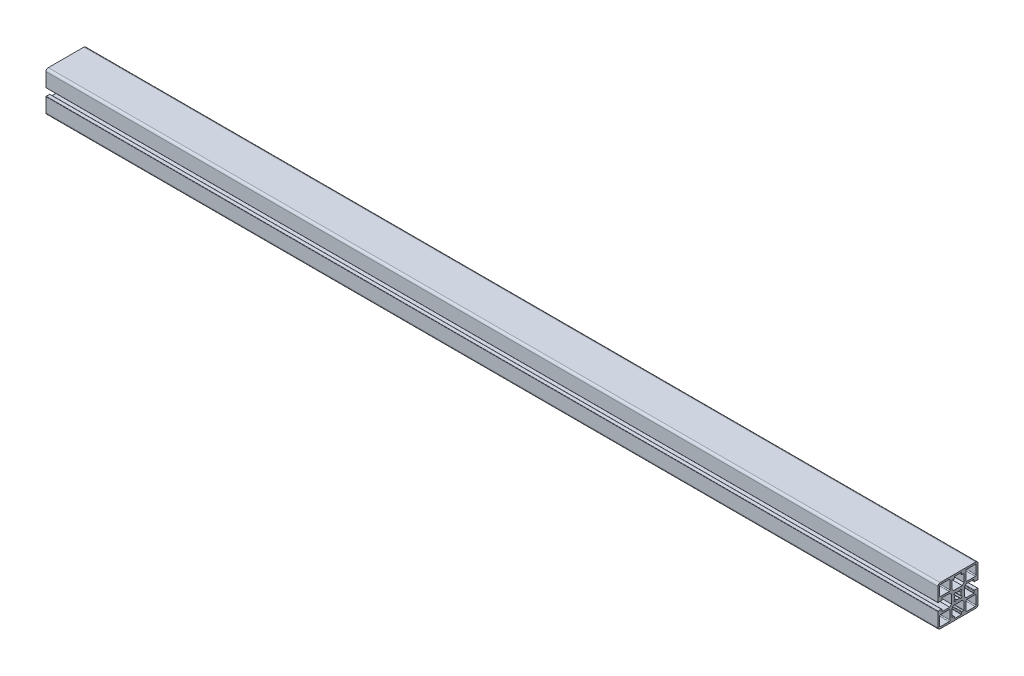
from build123d import *

# Parameters (mm, degrees)
F_45_SARJA_1_0173_45X45_L_2SS_VASTA_VAHV_1_DEPTH = 1000


with BuildPart() as part:
    # Model → 45-sarja 1.0173 45X45 L 2SS VASTA VAHV_1 (new body)
    with BuildSketch(Plane(origin=(0, 0, 0), x_dir=(0, 0, -1), z_dir=(1, 0, 0))):
        with BuildLine():
            Line((-22.5, 20), (-22.5, 4.4))
            ThreePointArc((-22.5, 4.4), (-22.412132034, 4.187867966), (-22.2, 4.1))
            Line((-22.2, 4.1), (-18.5, 4.1))
            ThreePointArc((-18.5, 4.1), (-18.146446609, 4.246446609), (-18, 4.6))
            Line((-18, 4.6), (-18, 6.5))
            ThreePointArc((-18, 6.5), (-17.912132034, 6.712132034), (-17.7, 6.8))
            Line((-17.7, 6.8), (-9.2, 6.8))
            Line((-9.2, 6.8), (-7.2, 4.8))
            Line((-7.2, 4.8), (-7.2, -4.8))
            Line((-7.2, -4.8), (-9.2, -6.8))
            Line((-9.2, -6.8), (-17.7, -6.8))
            ThreePointArc((-17.7, -6.8), (-17.912132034, -6.712132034), (-18, -6.5))
            Line((-18, -6.5), (-18, -4.6))
            ThreePointArc((-18, -4.6), (-18.146446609, -4.246446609), (-18.5, -4.1))
            Line((-18.5, -4.1), (-22.2, -4.1))
            ThreePointArc((-22.2, -4.1), (-22.412132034, -4.187867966), (-22.5, -4.4))
            Line((-22.5, -4.4), (-22.5, -20))
            ThreePointArc((-22.5, -20), (-21.767766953, -21.767766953), (-20, -22.5))
            Line((-20, -22.5), (20, -22.5))
            ThreePointArc((20, -22.5), (21.767766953, -21.767766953), (22.5, -20))
            Line((22.5, -20), (22.5, -4.4))
            ThreePointArc((22.5, -4.4), (22.412132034, -4.187867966), (22.2, -4.1))
            Line((22.2, -4.1), (18.5, -4.1))
            ThreePointArc((18.5, -4.1), (18.146446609, -4.246446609), (18, -4.6))
            Line((18, -4.6), (18, -6.5))
            ThreePointArc((18, -6.5), (17.912132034, -6.712132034), (17.7, -6.8))
            Line((17.7, -6.8), (9.2, -6.8))
            Line((9.2, -6.8), (7.2, -4.8))
            Line((7.2, -4.8), (7.2, 4.8))
            Line((7.2, 4.8), (9.2, 6.8))
            Line((9.2, 6.8), (17.7, 6.8))
            ThreePointArc((17.7, 6.8), (17.912132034, 6.712132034), (18, 6.5))
            Line((18, 6.5), (18, 4.6))
            ThreePointArc((18, 4.6), (18.146446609, 4.246446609), (18.5, 4.1))
            Line((18.5, 4.1), (22.2, 4.1))
            ThreePointArc((22.2, 4.1), (22.412132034, 4.187867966), (22.5, 4.4))
            Line((22.5, 4.4), (22.5, 20))
            ThreePointArc((22.5, 20), (21.767766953, 21.767766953), (20, 22.5))
            Line((20, 22.5), (-20, 22.5))
            ThreePointArc((-20, 22.5), (-21.767766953, 21.767766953), (-22.5, 20))
        make_face()
        with BuildLine():
            Line((6.5, 18), (4.6, 18))
            ThreePointArc((4.6, 18), (4.246446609, 18.146446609), (4.1, 18.5))
            Line((4.1, 18.5), (4.1, 20.2))
            ThreePointArc((4.1, 20.2), (4.012132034, 20.412132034), (3.8, 20.5))
            Line((3.8, 20.5), (-3.8, 20.5))
            ThreePointArc((-3.8, 20.5), (-4.012132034, 20.412132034), (-4.1, 20.2))
            Line((-4.1, 20.2), (-4.1, 18.5))
            ThreePointArc((-4.1, 18.5), (-4.246446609, 18.146446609), (-4.6, 18))
            Line((-4.6, 18), (-6.5, 18))
            ThreePointArc((-6.5, 18), (-6.712132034, 17.912132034), (-6.8, 17.7))
            Line((-6.8, 17.7), (-6.8, 9.2))
            Line((-6.8, 9.2), (-4.8, 7.2))
            Line((-4.8, 7.2), (4.8, 7.2))
            Line((4.8, 7.2), (6.8, 9.2))
            Line((6.8, 9.2), (6.8, 17.7))
            ThreePointArc((6.8, 17.7), (6.712132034, 17.912132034), (6.5, 18))
        make_face(mode=Mode.SUBTRACT)
        with BuildLine():
            Line((-9.8, 20.5), (-19.5, 20.5))
            ThreePointArc((-19.5, 20.5), (-20.207106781, 20.207106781), (-20.5, 19.5))
            Line((-20.5, 19.5), (-20.5, 9.8))
            ThreePointArc((-20.5, 9.8), (-20.207106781, 9.092893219), (-19.5, 8.8))
            Line((-19.5, 8.8), (-9.8, 8.8))
            ThreePointArc((-9.8, 8.8), (-9.092893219, 9.092893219), (-8.8, 9.8))
            Line((-8.8, 9.8), (-8.8, 19.5))
            ThreePointArc((-8.8, 19.5), (-9.092893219, 20.207106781), (-9.8, 20.5))
        make_face(mode=Mode.SUBTRACT)
        with BuildLine():
            Line((9.8, -20.5), (19.5, -20.5))
            ThreePointArc((19.5, -20.5), (20.207106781, -20.207106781), (20.5, -19.5))
            Line((20.5, -19.5), (20.5, -9.8))
            ThreePointArc((20.5, -9.8), (20.207106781, -9.092893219), (19.5, -8.8))
            Line((19.5, -8.8), (9.8, -8.8))
            ThreePointArc((9.8, -8.8), (9.092893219, -9.092893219), (8.8, -9.8))
            Line((8.8, -9.8), (8.8, -19.5))
            ThreePointArc((8.8, -19.5), (9.092893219, -20.207106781), (9.8, -20.5))
        make_face(mode=Mode.SUBTRACT)
        with BuildLine():
            Line((20.5, 9.8), (20.5, 19.5))
            ThreePointArc((20.5, 19.5), (20.207106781, 20.207106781), (19.5, 20.5))
            Line((19.5, 20.5), (9.8, 20.5))
            ThreePointArc((9.8, 20.5), (9.092893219, 20.207106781), (8.8, 19.5))
            Line((8.8, 19.5), (8.8, 9.8))
            ThreePointArc((8.8, 9.8), (9.092893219, 9.092893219), (9.8, 8.8))
            Line((9.8, 8.8), (19.5, 8.8))
            ThreePointArc((19.5, 8.8), (20.207106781, 9.092893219), (20.5, 9.8))
        make_face(mode=Mode.SUBTRACT)
        with BuildLine():
            Line((-3.8, -20.5), (3.8, -20.5))
            ThreePointArc((3.8, -20.5), (4.012132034, -20.412132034), (4.1, -20.2))
            Line((4.1, -20.2), (4.1, -18.5))
            ThreePointArc((4.1, -18.5), (4.246446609, -18.146446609), (4.6, -18))
            Line((4.6, -18), (6.5, -18))
            ThreePointArc((6.5, -18), (6.712132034, -17.912132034), (6.8, -17.7))
            Line((6.8, -17.7), (6.8, -9.2))
            Line((6.8, -9.2), (4.8, -7.2))
            Line((4.8, -7.2), (-4.8, -7.2))
            Line((-4.8, -7.2), (-6.8, -9.2))
            Line((-6.8, -9.2), (-6.8, -17.7))
            ThreePointArc((-6.8, -17.7), (-6.712132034, -17.912132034), (-6.5, -18))
            Line((-6.5, -18), (-4.6, -18))
            ThreePointArc((-4.6, -18), (-4.246446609, -18.146446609), (-4.1, -18.5))
            Line((-4.1, -18.5), (-4.1, -20.2))
            ThreePointArc((-4.1, -20.2), (-4.012132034, -20.412132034), (-3.8, -20.5))
        make_face(mode=Mode.SUBTRACT)
        with BuildLine():
            Line((3.363290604, 1.949077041), (4.384062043, 2.969848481))
            ThreePointArc((4.384062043, 2.969848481), (4.471930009, 3.181980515), (4.384062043, 3.39411255))
            Line((4.384062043, 3.39411255), (3.39411255, 4.384062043))
            ThreePointArc((3.39411255, 4.384062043), (3.181980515, 4.471930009), (2.969848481, 4.384062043))
            Line((2.969848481, 4.384062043), (1.949077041, 3.363290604))
            ThreePointArc((1.949077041, 3.363290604), (1.786690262, 3.279575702), (1.605854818, 3.30557942))
            ThreePointArc((1.605854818, 3.30557942), (0, 3.675), (-1.605854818, 3.30557942))
            ThreePointArc((-1.605854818, 3.30557942), (-1.786690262, 3.279575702), (-1.949077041, 3.363290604))
            Line((-1.949077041, 3.363290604), (-2.969848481, 4.384062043))
            ThreePointArc((-2.969848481, 4.384062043), (-3.181980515, 4.471930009), (-3.39411255, 4.384062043))
            Line((-3.39411255, 4.384062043), (-4.384062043, 3.39411255))
            ThreePointArc((-4.384062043, 3.39411255), (-4.471930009, 3.181980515), (-4.384062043, 2.969848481))
            Line((-4.384062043, 2.969848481), (-3.363290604, 1.949077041))
            ThreePointArc((-3.363290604, 1.949077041), (-3.279575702, 1.786690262), (-3.30557942, 1.605854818))
            ThreePointArc((-3.30557942, 1.605854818), (-3.675, 0), (-3.30557942, -1.605854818))
            ThreePointArc((-3.30557942, -1.605854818), (-3.279575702, -1.786690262), (-3.363290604, -1.949077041))
            Line((-3.363290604, -1.949077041), (-4.384062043, -2.969848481))
            ThreePointArc((-4.384062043, -2.969848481), (-4.471930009, -3.181980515), (-4.384062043, -3.39411255))
            Line((-4.384062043, -3.39411255), (-3.39411255, -4.384062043))
            ThreePointArc((-3.39411255, -4.384062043), (-3.181980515, -4.471930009), (-2.969848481, -4.384062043))
            Line((-2.969848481, -4.384062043), (-1.949077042, -3.363290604))
            ThreePointArc((-1.949077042, -3.363290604), (-1.786690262, -3.279575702), (-1.605854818, -3.30557942))
            ThreePointArc((-1.605854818, -3.30557942), (0, -3.675), (1.605854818, -3.30557942))
            ThreePointArc((1.605854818, -3.30557942), (1.786690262, -3.279575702), (1.949077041, -3.363290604))
            Line((1.949077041, -3.363290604), (2.969848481, -4.384062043))
            ThreePointArc((2.969848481, -4.384062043), (3.181980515, -4.471930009), (3.39411255, -4.384062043))
            Line((3.39411255, -4.384062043), (4.384062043, -3.39411255))
            ThreePointArc((4.384062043, -3.39411255), (4.471930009, -3.181980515), (4.384062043, -2.969848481))
            Line((4.384062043, -2.969848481), (3.363290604, -1.949077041))
            ThreePointArc((3.363290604, -1.949077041), (3.279575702, -1.786690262), (3.30557942, -1.605854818))
            ThreePointArc((3.30557942, -1.605854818), (3.675, 0), (3.30557942, 1.605854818))
            ThreePointArc((3.30557942, 1.605854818), (3.279575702, 1.786690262), (3.363290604, 1.949077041))
        make_face(mode=Mode.SUBTRACT)
        with BuildLine():
            Line((-19.5, -20.5), (-9.8, -20.5))
            ThreePointArc((-9.8, -20.5), (-9.092893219, -20.207106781), (-8.8, -19.5))
            Line((-8.8, -19.5), (-8.8, -9.8))
            ThreePointArc((-8.8, -9.8), (-9.092893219, -9.092893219), (-9.8, -8.8))
            Line((-9.8, -8.8), (-19.5, -8.8))
            ThreePointArc((-19.5, -8.8), (-20.207106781, -9.092893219), (-20.5, -9.8))
            Line((-20.5, -9.8), (-20.5, -19.5))
            ThreePointArc((-20.5, -19.5), (-20.207106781, -20.207106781), (-19.5, -20.5))
        make_face(mode=Mode.SUBTRACT)
    extrude(amount=F_45_SARJA_1_0173_45X45_L_2SS_VASTA_VAHV_1_DEPTH)


solid = part.part
